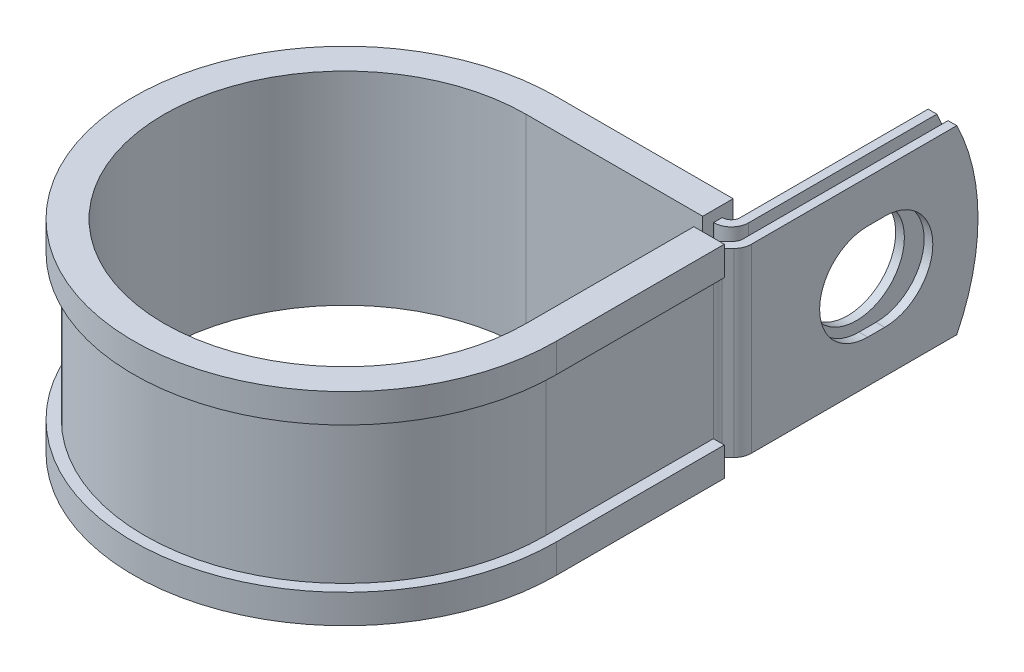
ISO-10303-21;
HEADER;
FILE_DESCRIPTION(('STEP AP214'),'2;1');
FILE_NAME('part.step','',(''),(''),'','','');
FILE_SCHEMA(('AUTOMOTIVE_DESIGN { 1 0 10303 214 1 1 1 1 }'));
ENDSEC;
DATA;
#1=APPLICATION_CONTEXT('core data for automotive mechanical design processes');
#2=APPLICATION_PROTOCOL_DEFINITION('international standard','automotive_design',2000,#1);
#3=PRODUCT_CONTEXT('',#1,'mechanical');
#4=PRODUCT('Part','Part','',(#3));
#5=PRODUCT_RELATED_PRODUCT_CATEGORY('part','',(#4));
#6=PRODUCT_DEFINITION_FORMATION('','',#4);
#7=PRODUCT_DEFINITION_CONTEXT('part definition',#1,'design');
#8=PRODUCT_DEFINITION('design','',#6,#7);
#9=PRODUCT_DEFINITION_SHAPE('','',#8);
#10=(LENGTH_UNIT() NAMED_UNIT(*) SI_UNIT(.MILLI.,.METRE.));
#11=(NAMED_UNIT(*) PLANE_ANGLE_UNIT() SI_UNIT($,.RADIAN.));
#12=(NAMED_UNIT(*) SI_UNIT($,.STERADIAN.) SOLID_ANGLE_UNIT());
#13=UNCERTAINTY_MEASURE_WITH_UNIT(LENGTH_MEASURE(1.E-05),#10,'distance_accuracy_value','');
#14=(GEOMETRIC_REPRESENTATION_CONTEXT(3) GLOBAL_UNCERTAINTY_ASSIGNED_CONTEXT((#13)) GLOBAL_UNIT_ASSIGNED_CONTEXT((#10,
#11,#12)) REPRESENTATION_CONTEXT('',''));
#15=CARTESIAN_POINT('',(0.,0.,0.));
#16=DIRECTION('',(0.,0.,1.));
#17=DIRECTION('',(1.,0.,0.));
#18=AXIS2_PLACEMENT_3D('',#15,#16,#17);
#19=CARTESIAN_POINT('',(27.6022698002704,-12.7,-26.924));
#20=DIRECTION('',(0.,1.,0.));
#21=DIRECTION('',(1.,0.,0.));
#22=AXIS2_PLACEMENT_3D('',#19,#20,#21);
#23=PLANE('',#22);
#24=DIRECTION('',(0.,0.,-1.));
#25=VECTOR('',#24,1.);
#26=CARTESIAN_POINT('',(24.7574698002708,-12.7,-26.924));
#27=LINE('',#26,#25);
#28=CARTESIAN_POINT('',(24.7574698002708,-12.7,-26.924));
#29=VERTEX_POINT('',#28);
#30=CARTESIAN_POINT('',(24.7574698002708,-12.7,-28.1432));
#31=VERTEX_POINT('',#30);
#32=EDGE_CURVE('E505',#29,#31,#27,.T.);
#33=ORIENTED_EDGE('',*,*,#32,.T.);
#34=DIRECTION('',(-1.,0.,0.));
#35=VECTOR('',#34,1.);
#36=CARTESIAN_POINT('',(0.,-12.7,-28.1432));
#37=LINE('',#36,#35);
#38=CARTESIAN_POINT('',(24.8082698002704,-12.7,-28.1432));
#39=VERTEX_POINT('',#38);
#40=EDGE_CURVE('E392',#39,#31,#37,.T.);
#41=ORIENTED_EDGE('',*,*,#40,.F.);
#42=CARTESIAN_POINT('',(24.8082698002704,-12.7,-29.3624));
#43=DIRECTION('',(0.,1.,0.));
#44=DIRECTION('',(1.,0.,0.));
#45=AXIS2_PLACEMENT_3D('',#42,#43,#44);
#46=CIRCLE('',#45,1.2192);
#47=CARTESIAN_POINT('',(26.0274698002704,-12.7,-29.3624));
#48=VERTEX_POINT('',#47);
#49=EDGE_CURVE('E390',#48,#39,#46,.F.);
#50=ORIENTED_EDGE('',*,*,#49,.F.);
#51=DIRECTION('',(0.,0.,1.));
#52=VECTOR('',#51,1.);
#53=CARTESIAN_POINT('',(26.0274698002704,-12.7,-58.7248));
#54=LINE('',#53,#52);
#55=CARTESIAN_POINT('',(26.0274698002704,-12.7,-55.7474683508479));
#56=VERTEX_POINT('',#55);
#57=EDGE_CURVE('E388',#56,#48,#54,.T.);
#58=ORIENTED_EDGE('',*,*,#57,.F.);
#59=DIRECTION('',(-1.,0.,0.));
#60=VECTOR('',#59,1.);
#61=CARTESIAN_POINT('',(30.0406698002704,-12.7,-55.7474683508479));
#62=LINE('',#61,#60);
#63=CARTESIAN_POINT('',(27.2466698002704,-12.7,-55.7474683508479));
#64=VERTEX_POINT('',#63);
#65=EDGE_CURVE('E11',#64,#56,#62,.T.);
#66=ORIENTED_EDGE('',*,*,#65,.F.);
#67=DIRECTION('',(0.,0.,1.));
#68=VECTOR('',#67,1.);
#69=CARTESIAN_POINT('',(27.2466698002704,-12.7,-58.7248));
#70=LINE('',#69,#68);
#71=CARTESIAN_POINT('',(27.2466698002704,-12.7,-29.3624));
#72=VERTEX_POINT('',#71);
#73=EDGE_CURVE('E386',#64,#72,#70,.T.);
#74=ORIENTED_EDGE('',*,*,#73,.T.);
#75=CARTESIAN_POINT('',(24.8082698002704,-12.7,-29.3624));
#76=DIRECTION('',(0.,-1.,0.));
#77=DIRECTION('',(0.,0.,1.));
#78=AXIS2_PLACEMENT_3D('',#75,#76,#77);
#79=CIRCLE('',#78,2.4384);
#80=CARTESIAN_POINT('',(24.8082698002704,-12.7,-26.924));
#81=VERTEX_POINT('',#80);
#82=EDGE_CURVE('E383',#72,#81,#79,.T.);
#83=ORIENTED_EDGE('',*,*,#82,.T.);
#84=DIRECTION('',(-1.,0.,0.));
#85=VECTOR('',#84,1.);
#86=CARTESIAN_POINT('',(0.,-12.7,-26.924));
#87=LINE('',#86,#85);
#88=EDGE_CURVE('E380',#81,#29,#87,.T.);
#89=ORIENTED_EDGE('',*,*,#88,.T.);
#90=EDGE_LOOP('',(#33,#41,#50,#58,#66,#74,#83,#89));
#91=FACE_BOUND('',#90,.T.);
#92=ADVANCED_FACE('F36',(#91),#23,.F.);
#93=CARTESIAN_POINT('',(27.6022698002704,12.7,-26.924));
#94=DIRECTION('',(0.,1.,0.));
#95=DIRECTION('',(1.,0.,0.));
#96=AXIS2_PLACEMENT_3D('',#93,#94,#95);
#97=PLANE('',#96);
#98=DIRECTION('',(-1.,0.,0.));
#99=VECTOR('',#98,1.);
#100=CARTESIAN_POINT('',(0.,12.7,-28.1432));
#101=LINE('',#100,#99);
#102=CARTESIAN_POINT('',(24.8082698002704,12.7,-28.1432));
#103=VERTEX_POINT('',#102);
#104=CARTESIAN_POINT('',(24.7574698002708,12.7,-28.1432));
#105=VERTEX_POINT('',#104);
#106=EDGE_CURVE('E350',#103,#105,#101,.T.);
#107=ORIENTED_EDGE('',*,*,#106,.T.);
#108=DIRECTION('',(0.,0.,1.));
#109=VECTOR('',#108,1.);
#110=CARTESIAN_POINT('',(24.7574698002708,12.7,-28.1432));
#111=LINE('',#110,#109);
#112=CARTESIAN_POINT('',(24.7574698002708,12.7,-26.924));
#113=VERTEX_POINT('',#112);
#114=EDGE_CURVE('E499',#105,#113,#111,.T.);
#115=ORIENTED_EDGE('',*,*,#114,.T.);
#116=DIRECTION('',(-1.,0.,0.));
#117=VECTOR('',#116,1.);
#118=CARTESIAN_POINT('',(0.,12.7,-26.924));
#119=LINE('',#118,#117);
#120=CARTESIAN_POINT('',(24.8082698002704,12.7,-26.924));
#121=VERTEX_POINT('',#120);
#122=EDGE_CURVE('E607',#121,#113,#119,.T.);
#123=ORIENTED_EDGE('',*,*,#122,.F.);
#124=CARTESIAN_POINT('',(24.8082698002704,12.7,-29.3624));
#125=DIRECTION('',(0.,-1.,0.));
#126=DIRECTION('',(0.,0.,1.));
#127=AXIS2_PLACEMENT_3D('',#124,#125,#126);
#128=CIRCLE('',#127,2.4384);
#129=CARTESIAN_POINT('',(27.2466698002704,12.7,-29.3624));
#130=VERTEX_POINT('',#129);
#131=EDGE_CURVE('E352',#130,#121,#128,.T.);
#132=ORIENTED_EDGE('',*,*,#131,.F.);
#133=DIRECTION('',(0.,0.,1.));
#134=VECTOR('',#133,1.);
#135=CARTESIAN_POINT('',(27.2466698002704,12.7,-58.7248));
#136=LINE('',#135,#134);
#137=CARTESIAN_POINT('',(27.2466698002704,12.7,-55.7474683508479));
#138=VERTEX_POINT('',#137);
#139=EDGE_CURVE('E343',#138,#130,#136,.T.);
#140=ORIENTED_EDGE('',*,*,#139,.F.);
#141=DIRECTION('',(-1.,0.,0.));
#142=VECTOR('',#141,1.);
#143=CARTESIAN_POINT('',(30.0406698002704,12.7,-55.7474683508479));
#144=LINE('',#143,#142);
#145=CARTESIAN_POINT('',(26.0274698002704,12.7,-55.7474683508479));
#146=VERTEX_POINT('',#145);
#147=EDGE_CURVE('E44',#138,#146,#144,.T.);
#148=ORIENTED_EDGE('',*,*,#147,.T.);
#149=DIRECTION('',(0.,0.,1.));
#150=VECTOR('',#149,1.);
#151=CARTESIAN_POINT('',(26.0274698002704,12.7,-58.7248));
#152=LINE('',#151,#150);
#153=CARTESIAN_POINT('',(26.0274698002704,12.7,-29.3624));
#154=VERTEX_POINT('',#153);
#155=EDGE_CURVE('E340',#146,#154,#152,.T.);
#156=ORIENTED_EDGE('',*,*,#155,.T.);
#157=CARTESIAN_POINT('',(24.8082698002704,12.7,-29.3624));
#158=DIRECTION('',(0.,1.,0.));
#159=DIRECTION('',(1.,0.,0.));
#160=AXIS2_PLACEMENT_3D('',#157,#158,#159);
#161=CIRCLE('',#160,1.2192);
#162=EDGE_CURVE('E348',#154,#103,#161,.F.);
#163=ORIENTED_EDGE('',*,*,#162,.T.);
#164=EDGE_LOOP('',(#107,#115,#123,#132,#140,#148,#156,#163));
#165=FACE_BOUND('',#164,.T.);
#166=ADVANCED_FACE('F339',(#165),#97,.T.);
#167=CARTESIAN_POINT('',(0.,12.7,-26.924));
#168=DIRECTION('',(0.,0.,1.));
#169=DIRECTION('',(1.,0.,0.));
#170=AXIS2_PLACEMENT_3D('',#167,#168,#169);
#171=PLANE('',#170);
#172=ORIENTED_EDGE('',*,*,#122,.T.);
#173=DIRECTION('',(0.,-1.,0.));
#174=VECTOR('',#173,1.);
#175=CARTESIAN_POINT('',(24.7574698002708,12.7,-26.924));
#176=LINE('',#175,#174);
#177=EDGE_CURVE('E502',#113,#29,#176,.T.);
#178=ORIENTED_EDGE('',*,*,#177,.T.);
#179=ORIENTED_EDGE('',*,*,#88,.F.);
#180=DIRECTION('',(0.,-1.,0.));
#181=VECTOR('',#180,1.);
#182=CARTESIAN_POINT('',(24.8082698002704,12.7,-26.924));
#183=LINE('',#182,#181);
#184=EDGE_CURVE('E326',#121,#81,#183,.T.);
#185=ORIENTED_EDGE('',*,*,#184,.F.);
#186=EDGE_LOOP('',(#172,#178,#179,#185));
#187=FACE_BOUND('',#186,.T.);
#188=ADVANCED_FACE('F617',(#187),#171,.T.);
#189=CARTESIAN_POINT('',(30.0406698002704,12.7,-26.924));
#190=DIRECTION('',(-1.,0.,0.));
#191=DIRECTION('',(0.,0.,1.));
#192=AXIS2_PLACEMENT_3D('',#189,#190,#191);
#193=PLANE('',#192);
#194=CARTESIAN_POINT('',(30.0406698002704,0.,-45.6437999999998));
#195=DIRECTION('',(1.,0.,0.));
#196=DIRECTION('',(0.,0.,-1.));
#197=AXIS2_PLACEMENT_3D('',#194,#195,#196);
#198=CIRCLE('',#197,6.7437);
#199=CARTESIAN_POINT('',(30.0406698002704,-6.7437,-45.6438000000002));
#200=VERTEX_POINT('',#199);
#201=CARTESIAN_POINT('',(30.0406698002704,6.7437,-45.6438000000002));
#202=VERTEX_POINT('',#201);
#203=EDGE_CURVE('E562',#200,#202,#198,.T.);
#204=ORIENTED_EDGE('',*,*,#203,.F.);
#205=DIRECTION('',(0.,0.,-1.));
#206=VECTOR('',#205,1.);
#207=CARTESIAN_POINT('',(30.0406698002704,-6.7437,-43.2561999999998));
#208=LINE('',#207,#206);
#209=CARTESIAN_POINT('',(30.0406698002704,-6.7437,-43.2561999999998));
#210=VERTEX_POINT('',#209);
#211=EDGE_CURVE('E565',#210,#200,#208,.T.);
#212=ORIENTED_EDGE('',*,*,#211,.F.);
#213=CARTESIAN_POINT('',(30.0406698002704,0.,-43.2561999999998));
#214=DIRECTION('',(1.,0.,0.));
#215=DIRECTION('',(0.,0.,-1.));
#216=AXIS2_PLACEMENT_3D('',#213,#214,#215);
#217=CIRCLE('',#216,6.7437);
#218=CARTESIAN_POINT('',(30.0406698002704,6.7437,-43.2561999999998));
#219=VERTEX_POINT('',#218);
#220=EDGE_CURVE('E558',#219,#210,#217,.T.);
#221=ORIENTED_EDGE('',*,*,#220,.F.);
#222=DIRECTION('',(0.,0.,1.));
#223=VECTOR('',#222,1.);
#224=CARTESIAN_POINT('',(30.0406698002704,6.7437,-43.2561999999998));
#225=LINE('',#224,#223);
#226=EDGE_CURVE('E559',#202,#219,#225,.T.);
#227=ORIENTED_EDGE('',*,*,#226,.F.);
#228=EDGE_LOOP('',(#204,#212,#221,#227));
#229=FACE_BOUND('',#228,.T.);
#230=DIRECTION('',(0.,0.,-1.));
#231=VECTOR('',#230,1.);
#232=CARTESIAN_POINT('',(30.0406698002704,-12.7,-26.924));
#233=LINE('',#232,#231);
#234=CARTESIAN_POINT('',(30.0406698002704,-12.7,-26.924));
#235=VERTEX_POINT('',#234);
#236=CARTESIAN_POINT('',(30.0406698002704,-12.7,-55.7474683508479));
#237=VERTEX_POINT('',#236);
#238=EDGE_CURVE('E364',#235,#237,#233,.T.);
#239=ORIENTED_EDGE('',*,*,#238,.T.);
#240=CARTESIAN_POINT('',(30.0406698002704,0.,-30.1498));
#241=DIRECTION('',(-1.,0.,0.));
#242=DIRECTION('',(0.,0.,1.));
#243=AXIS2_PLACEMENT_3D('',#240,#241,#242);
#244=CIRCLE('',#243,28.575);
#245=CARTESIAN_POINT('',(30.0406698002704,12.7,-55.7474683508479));
#246=VERTEX_POINT('',#245);
#247=EDGE_CURVE('E550',#246,#237,#244,.T.);
#248=ORIENTED_EDGE('',*,*,#247,.F.);
#249=DIRECTION('',(0.,0.,-1.));
#250=VECTOR('',#249,1.);
#251=CARTESIAN_POINT('',(30.0406698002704,12.7,-26.924));
#252=LINE('',#251,#250);
#253=CARTESIAN_POINT('',(30.0406698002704,12.7,-26.924));
#254=VERTEX_POINT('',#253);
#255=EDGE_CURVE('E401',#254,#246,#252,.T.);
#256=ORIENTED_EDGE('',*,*,#255,.F.);
#257=DIRECTION('',(0.,-1.,0.));
#258=VECTOR('',#257,1.);
#259=CARTESIAN_POINT('',(30.0406698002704,12.7,-26.924));
#260=LINE('',#259,#258);
#261=EDGE_CURVE('E363',#254,#235,#260,.T.);
#262=ORIENTED_EDGE('',*,*,#261,.T.);
#263=EDGE_LOOP('',(#239,#248,#256,#262));
#264=FACE_BOUND('',#263,.T.);
#265=ADVANCED_FACE('F38',(#229,#264),#193,.F.);
#266=CARTESIAN_POINT('',(28.8214698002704,12.7,-26.924));
#267=DIRECTION('',(-1.,0.,0.));
#268=DIRECTION('',(0.,0.,1.));
#269=AXIS2_PLACEMENT_3D('',#266,#267,#268);
#270=PLANE('',#269);
#271=DIRECTION('',(0.,0.,-1.));
#272=VECTOR('',#271,1.);
#273=CARTESIAN_POINT('',(28.8214698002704,-6.7437,-43.2561999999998));
#274=LINE('',#273,#272);
#275=CARTESIAN_POINT('',(28.8214698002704,-6.7437,-43.2561999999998));
#276=VERTEX_POINT('',#275);
#277=CARTESIAN_POINT('',(28.8214698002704,-6.7437,-45.6438000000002));
#278=VERTEX_POINT('',#277);
#279=EDGE_CURVE('E561',#276,#278,#274,.T.);
#280=ORIENTED_EDGE('',*,*,#279,.T.);
#281=CARTESIAN_POINT('',(28.8214698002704,0.,-45.6437999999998));
#282=DIRECTION('',(-1.,0.,0.));
#283=DIRECTION('',(0.,0.,1.));
#284=AXIS2_PLACEMENT_3D('',#281,#282,#283);
#285=CIRCLE('',#284,6.7437);
#286=CARTESIAN_POINT('',(28.8214698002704,6.7437,-45.6438000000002));
#287=VERTEX_POINT('',#286);
#288=EDGE_CURVE('E582',#278,#287,#285,.F.);
#289=ORIENTED_EDGE('',*,*,#288,.T.);
#290=DIRECTION('',(0.,0.,1.));
#291=VECTOR('',#290,1.);
#292=CARTESIAN_POINT('',(28.8214698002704,6.7437,-43.2561999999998));
#293=LINE('',#292,#291);
#294=CARTESIAN_POINT('',(28.8214698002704,6.7437,-43.2561999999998));
#295=VERTEX_POINT('',#294);
#296=EDGE_CURVE('E578',#287,#295,#293,.T.);
#297=ORIENTED_EDGE('',*,*,#296,.T.);
#298=CARTESIAN_POINT('',(28.8214698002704,0.,-43.2561999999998));
#299=DIRECTION('',(-1.,0.,0.));
#300=DIRECTION('',(0.,0.,1.));
#301=AXIS2_PLACEMENT_3D('',#298,#299,#300);
#302=CIRCLE('',#301,6.7437);
#303=EDGE_CURVE('E573',#295,#276,#302,.F.);
#304=ORIENTED_EDGE('',*,*,#303,.T.);
#305=EDGE_LOOP('',(#280,#289,#297,#304));
#306=FACE_BOUND('',#305,.T.);
#307=CARTESIAN_POINT('',(28.8214698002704,0.,-30.1498));
#308=DIRECTION('',(-1.,0.,0.));
#309=DIRECTION('',(0.,0.,1.));
#310=AXIS2_PLACEMENT_3D('',#307,#308,#309);
#311=CIRCLE('',#310,28.575);
#312=CARTESIAN_POINT('',(28.8214698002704,12.7,-55.7474683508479));
#313=VERTEX_POINT('',#312);
#314=CARTESIAN_POINT('',(28.8214698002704,-12.7,-55.7474683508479));
#315=VERTEX_POINT('',#314);
#316=EDGE_CURVE('E58',#313,#315,#311,.T.);
#317=ORIENTED_EDGE('',*,*,#316,.T.);
#318=DIRECTION('',(0.,0.,-1.));
#319=VECTOR('',#318,1.);
#320=CARTESIAN_POINT('',(28.8214698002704,-12.7,-26.924));
#321=LINE('',#320,#319);
#322=CARTESIAN_POINT('',(28.8214698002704,-12.7,-26.924));
#323=VERTEX_POINT('',#322);
#324=EDGE_CURVE('E367',#323,#315,#321,.T.);
#325=ORIENTED_EDGE('',*,*,#324,.F.);
#326=DIRECTION('',(0.,-1.,0.));
#327=VECTOR('',#326,1.);
#328=CARTESIAN_POINT('',(28.8214698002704,12.7,-26.924));
#329=LINE('',#328,#327);
#330=CARTESIAN_POINT('',(28.8214698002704,12.7,-26.924));
#331=VERTEX_POINT('',#330);
#332=EDGE_CURVE('E334',#331,#323,#329,.T.);
#333=ORIENTED_EDGE('',*,*,#332,.F.);
#334=DIRECTION('',(0.,0.,-1.));
#335=VECTOR('',#334,1.);
#336=CARTESIAN_POINT('',(28.8214698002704,12.7,-26.924));
#337=LINE('',#336,#335);
#338=EDGE_CURVE('E597',#331,#313,#337,.T.);
#339=ORIENTED_EDGE('',*,*,#338,.T.);
#340=EDGE_LOOP('',(#317,#325,#333,#339));
#341=FACE_BOUND('',#340,.T.);
#342=ADVANCED_FACE('F671',(#306,#341),#270,.T.);
#343=CARTESIAN_POINT('',(27.2466698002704,12.7,-58.7248));
#344=DIRECTION('',(1.,0.,0.));
#345=DIRECTION('',(0.,0.,-1.));
#346=AXIS2_PLACEMENT_3D('',#343,#344,#345);
#347=PLANE('',#346);
#348=CARTESIAN_POINT('',(27.2466698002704,0.,-44.45));
#349=DIRECTION('',(1.,0.,0.));
#350=DIRECTION('',(0.,0.,-1.));
#351=AXIS2_PLACEMENT_3D('',#348,#349,#350);
#352=CIRCLE('',#351,6.7437);
#353=CARTESIAN_POINT('',(27.2466698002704,0.,-51.1937));
#354=VERTEX_POINT('',#353);
#355=EDGE_CURVE('E368',#354,#354,#352,.F.);
#356=ORIENTED_EDGE('',*,*,#355,.T.);
#357=EDGE_LOOP('',(#356));
#358=FACE_BOUND('',#357,.T.);
#359=ORIENTED_EDGE('',*,*,#73,.F.);
#360=CARTESIAN_POINT('',(27.2466698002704,0.,-30.1498));
#361=DIRECTION('',(1.,0.,0.));
#362=DIRECTION('',(0.,0.,-1.));
#363=AXIS2_PLACEMENT_3D('',#360,#361,#362);
#364=CIRCLE('',#363,28.575);
#365=EDGE_CURVE('E555',#64,#138,#364,.T.);
#366=ORIENTED_EDGE('',*,*,#365,.T.);
#367=ORIENTED_EDGE('',*,*,#139,.T.);
#368=DIRECTION('',(0.,-1.,0.));
#369=VECTOR('',#368,1.);
#370=CARTESIAN_POINT('',(27.2466698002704,12.7,-29.3624));
#371=LINE('',#370,#369);
#372=EDGE_CURVE('E323',#130,#72,#371,.T.);
#373=ORIENTED_EDGE('',*,*,#372,.T.);
#374=EDGE_LOOP('',(#359,#366,#367,#373));
#375=FACE_BOUND('',#374,.T.);
#376=ADVANCED_FACE('F623',(#358,#375),#347,.T.);
#377=CARTESIAN_POINT('',(26.0274698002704,12.7,-58.7248));
#378=DIRECTION('',(1.,0.,0.));
#379=DIRECTION('',(0.,0.,-1.));
#380=AXIS2_PLACEMENT_3D('',#377,#378,#379);
#381=PLANE('',#380);
#382=CARTESIAN_POINT('',(26.0274698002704,0.,-44.45));
#383=DIRECTION('',(-1.,0.,0.));
#384=DIRECTION('',(0.,0.,1.));
#385=AXIS2_PLACEMENT_3D('',#382,#383,#384);
#386=CIRCLE('',#385,6.7437);
#387=CARTESIAN_POINT('',(26.0274698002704,0.,-37.7063));
#388=VERTEX_POINT('',#387);
#389=EDGE_CURVE('E590',#388,#388,#386,.T.);
#390=ORIENTED_EDGE('',*,*,#389,.F.);
#391=EDGE_LOOP('',(#390));
#392=FACE_BOUND('',#391,.T.);
#393=CARTESIAN_POINT('',(26.0274698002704,0.,-30.1498));
#394=DIRECTION('',(-1.,0.,0.));
#395=DIRECTION('',(0.,0.,1.));
#396=AXIS2_PLACEMENT_3D('',#393,#394,#395);
#397=CIRCLE('',#396,28.575);
#398=EDGE_CURVE('E50',#146,#56,#397,.T.);
#399=ORIENTED_EDGE('',*,*,#398,.T.);
#400=ORIENTED_EDGE('',*,*,#57,.T.);
#401=DIRECTION('',(0.,-1.,0.));
#402=VECTOR('',#401,1.);
#403=CARTESIAN_POINT('',(26.0274698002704,12.7,-29.3624));
#404=LINE('',#403,#402);
#405=EDGE_CURVE('E320',#154,#48,#404,.T.);
#406=ORIENTED_EDGE('',*,*,#405,.F.);
#407=ORIENTED_EDGE('',*,*,#155,.F.);
#408=EDGE_LOOP('',(#399,#400,#406,#407));
#409=FACE_BOUND('',#408,.T.);
#410=ADVANCED_FACE('F346',(#392,#409),#381,.F.);
#411=CARTESIAN_POINT('',(29.3624,-12.7,-23.5115026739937));
#412=DIRECTION('',(0.,1.,0.));
#413=DIRECTION('',(1.,0.,0.));
#414=AXIS2_PLACEMENT_3D('',#411,#412,#413);
#415=CIRCLE('',#414,1.2192);
#416=CARTESIAN_POINT('',(28.1432,-12.7,-23.5115026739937));
#417=VERTEX_POINT('',#416);
#418=CARTESIAN_POINT('',(28.5002954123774,-12.7,-24.3736072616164));
#419=VERTEX_POINT('',#418);
#420=EDGE_CURVE('E395',#417,#419,#415,.F.);
#421=ORIENTED_EDGE('',*,*,#420,.F.);
#422=DIRECTION('',(1.,0.,0.));
#423=VECTOR('',#422,1.);
#424=CARTESIAN_POINT('',(26.924,-12.7,-23.5115026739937));
#425=LINE('',#424,#423);
#426=CARTESIAN_POINT('',(26.924,-12.7,-23.5115026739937));
#427=VERTEX_POINT('',#426);
#428=EDGE_CURVE('E433',#427,#417,#425,.T.);
#429=ORIENTED_EDGE('',*,*,#428,.F.);
#430=CARTESIAN_POINT('',(29.3624,-12.7,-23.5115026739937));
#431=DIRECTION('',(0.,-1.,0.));
#432=DIRECTION('',(0.,0.,1.));
#433=AXIS2_PLACEMENT_3D('',#430,#431,#432);
#434=CIRCLE('',#433,2.4384);
#435=CARTESIAN_POINT('',(27.6381908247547,-12.7,-25.235711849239));
#436=VERTEX_POINT('',#435);
#437=EDGE_CURVE('E377',#427,#436,#434,.T.);
#438=ORIENTED_EDGE('',*,*,#437,.T.);
#439=DIRECTION('',(0.707106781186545,0.,-0.70710678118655));
#440=VECTOR('',#439,1.);
#441=CARTESIAN_POINT('',(27.6381908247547,-12.7,-25.235711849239));
#442=LINE('',#441,#440);
#443=CARTESIAN_POINT('',(28.4643743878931,-12.7,-26.0618954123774));
#444=VERTEX_POINT('',#443);
#445=EDGE_CURVE('E374',#436,#444,#442,.T.);
#446=ORIENTED_EDGE('',*,*,#445,.T.);
#447=CARTESIAN_POINT('',(27.6022698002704,-12.7,-26.924));
#448=DIRECTION('',(0.,1.,0.));
#449=DIRECTION('',(0.,0.,1.));
#450=AXIS2_PLACEMENT_3D('',#447,#448,#449);
#451=CIRCLE('',#450,1.2192);
#452=EDGE_CURVE('E371',#444,#323,#451,.T.);
#453=ORIENTED_EDGE('',*,*,#452,.T.);
#454=ORIENTED_EDGE('',*,*,#324,.T.);
#455=DIRECTION('',(-1.,0.,0.));
#456=VECTOR('',#455,1.);
#457=CARTESIAN_POINT('',(30.0406698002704,-12.7,-55.7474683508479));
#458=LINE('',#457,#456);
#459=EDGE_CURVE('E548',#237,#315,#458,.T.);
#460=ORIENTED_EDGE('',*,*,#459,.F.);
#461=ORIENTED_EDGE('',*,*,#238,.F.);
#462=CARTESIAN_POINT('',(27.6022698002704,-12.7,-26.924));
#463=DIRECTION('',(0.,1.,0.));
#464=DIRECTION('',(1.,0.,0.));
#465=AXIS2_PLACEMENT_3D('',#462,#463,#464);
#466=CIRCLE('',#465,2.4384);
#467=CARTESIAN_POINT('',(29.3264789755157,-12.7,-25.1997908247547));
#468=VERTEX_POINT('',#467);
#469=EDGE_CURVE('E399',#468,#235,#466,.T.);
#470=ORIENTED_EDGE('',*,*,#469,.F.);
#471=DIRECTION('',(0.707106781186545,0.,-0.70710678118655));
#472=VECTOR('',#471,1.);
#473=CARTESIAN_POINT('',(28.5002954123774,-12.7,-24.3736072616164));
#474=LINE('',#473,#472);
#475=EDGE_CURVE('E397',#419,#468,#474,.T.);
#476=ORIENTED_EDGE('',*,*,#475,.F.);
#477=EDGE_LOOP('',(#421,#429,#438,#446,#453,#454,#460,#461,#470,#476));
#478=FACE_BOUND('',#477,.T.);
#479=ADVANCED_FACE('F657',(#478),#23,.F.);
#480=DIRECTION('',(-1.,0.,0.));
#481=VECTOR('',#480,1.);
#482=CARTESIAN_POINT('',(28.1432,12.7,-23.5115026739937));
#483=LINE('',#482,#481);
#484=CARTESIAN_POINT('',(28.1432,12.7,-23.5115026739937));
#485=VERTEX_POINT('',#484);
#486=CARTESIAN_POINT('',(26.924,12.7,-23.5115026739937));
#487=VERTEX_POINT('',#486);
#488=EDGE_CURVE('E422',#485,#487,#483,.T.);
#489=ORIENTED_EDGE('',*,*,#488,.F.);
#490=CARTESIAN_POINT('',(29.3624,12.7,-23.5115026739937));
#491=DIRECTION('',(0.,1.,0.));
#492=DIRECTION('',(1.,0.,0.));
#493=AXIS2_PLACEMENT_3D('',#490,#491,#492);
#494=CIRCLE('',#493,1.2192);
#495=CARTESIAN_POINT('',(28.5002954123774,12.7,-24.3736072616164));
#496=VERTEX_POINT('',#495);
#497=EDGE_CURVE('E357',#485,#496,#494,.F.);
#498=ORIENTED_EDGE('',*,*,#497,.T.);
#499=DIRECTION('',(0.707106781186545,0.,-0.70710678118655));
#500=VECTOR('',#499,1.);
#501=CARTESIAN_POINT('',(28.5002954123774,12.7,-24.3736072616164));
#502=LINE('',#501,#500);
#503=CARTESIAN_POINT('',(29.3264789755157,12.7,-25.1997908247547));
#504=VERTEX_POINT('',#503);
#505=EDGE_CURVE('E359',#496,#504,#502,.T.);
#506=ORIENTED_EDGE('',*,*,#505,.T.);
#507=CARTESIAN_POINT('',(27.6022698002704,12.7,-26.924));
#508=DIRECTION('',(0.,1.,0.));
#509=DIRECTION('',(1.,0.,0.));
#510=AXIS2_PLACEMENT_3D('',#507,#508,#509);
#511=CIRCLE('',#510,2.4384);
#512=EDGE_CURVE('E361',#504,#254,#511,.T.);
#513=ORIENTED_EDGE('',*,*,#512,.T.);
#514=ORIENTED_EDGE('',*,*,#255,.T.);
#515=DIRECTION('',(-1.,0.,0.));
#516=VECTOR('',#515,1.);
#517=CARTESIAN_POINT('',(30.0406698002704,12.7,-55.7474683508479));
#518=LINE('',#517,#516);
#519=EDGE_CURVE('E552',#246,#313,#518,.T.);
#520=ORIENTED_EDGE('',*,*,#519,.T.);
#521=ORIENTED_EDGE('',*,*,#338,.F.);
#522=CARTESIAN_POINT('',(27.6022698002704,12.7,-26.924));
#523=DIRECTION('',(0.,1.,0.));
#524=DIRECTION('',(0.,0.,1.));
#525=AXIS2_PLACEMENT_3D('',#522,#523,#524);
#526=CIRCLE('',#525,1.2192);
#527=CARTESIAN_POINT('',(28.4643743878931,12.7,-26.0618954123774));
#528=VERTEX_POINT('',#527);
#529=EDGE_CURVE('E600',#528,#331,#526,.T.);
#530=ORIENTED_EDGE('',*,*,#529,.F.);
#531=DIRECTION('',(0.707106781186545,0.,-0.70710678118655));
#532=VECTOR('',#531,1.);
#533=CARTESIAN_POINT('',(27.6381908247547,12.7,-25.235711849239));
#534=LINE('',#533,#532);
#535=CARTESIAN_POINT('',(27.6381908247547,12.7,-25.235711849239));
#536=VERTEX_POINT('',#535);
#537=EDGE_CURVE('E603',#536,#528,#534,.T.);
#538=ORIENTED_EDGE('',*,*,#537,.F.);
#539=CARTESIAN_POINT('',(29.3624,12.7,-23.5115026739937));
#540=DIRECTION('',(0.,-1.,0.));
#541=DIRECTION('',(0.,0.,1.));
#542=AXIS2_PLACEMENT_3D('',#539,#540,#541);
#543=CIRCLE('',#542,2.4384);
#544=EDGE_CURVE('E432',#487,#536,#543,.T.);
#545=ORIENTED_EDGE('',*,*,#544,.F.);
#546=EDGE_LOOP('',(#489,#498,#506,#513,#514,#520,#521,#530,#538,#545));
#547=FACE_BOUND('',#546,.T.);
#548=ADVANCED_FACE('F429',(#547),#97,.T.);
#549=CARTESIAN_POINT('',(27.6022698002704,12.7,-26.924));
#550=DIRECTION('',(0.,-1.,0.));
#551=DIRECTION('',(0.,0.,-1.));
#552=AXIS2_PLACEMENT_3D('',#549,#550,#551);
#553=CYLINDRICAL_SURFACE('',#552,1.2192);
#554=ORIENTED_EDGE('',*,*,#452,.F.);
#555=DIRECTION('',(0.,-1.,0.));
#556=VECTOR('',#555,1.);
#557=CARTESIAN_POINT('',(28.4643743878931,12.7,-26.0618954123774));
#558=LINE('',#557,#556);
#559=EDGE_CURVE('E332',#528,#444,#558,.T.);
#560=ORIENTED_EDGE('',*,*,#559,.F.);
#561=ORIENTED_EDGE('',*,*,#529,.T.);
#562=ORIENTED_EDGE('',*,*,#332,.T.);
#563=EDGE_LOOP('',(#554,#560,#561,#562));
#564=FACE_BOUND('',#563,.T.);
#565=ADVANCED_FACE('F667',(#564),#553,.F.);
#566=CARTESIAN_POINT('',(27.6381908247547,12.7,-25.235711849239));
#567=DIRECTION('',(-0.70710678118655,0.,-0.707106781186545));
#568=DIRECTION('',(-0.707106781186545,0.,0.70710678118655));
#569=AXIS2_PLACEMENT_3D('',#566,#567,#568);
#570=PLANE('',#569);
#571=ORIENTED_EDGE('',*,*,#445,.F.);
#572=DIRECTION('',(0.,-1.,0.));
#573=VECTOR('',#572,1.);
#574=CARTESIAN_POINT('',(27.6381908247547,12.7,-25.235711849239));
#575=LINE('',#574,#573);
#576=EDGE_CURVE('E330',#536,#436,#575,.T.);
#577=ORIENTED_EDGE('',*,*,#576,.F.);
#578=ORIENTED_EDGE('',*,*,#537,.T.);
#579=ORIENTED_EDGE('',*,*,#559,.T.);
#580=EDGE_LOOP('',(#571,#577,#578,#579));
#581=FACE_BOUND('',#580,.T.);
#582=ADVANCED_FACE('F662',(#581),#570,.T.);
#583=CARTESIAN_POINT('',(29.3624,12.7,-23.5115026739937));
#584=DIRECTION('',(0.,-1.,0.));
#585=DIRECTION('',(0.,0.,-1.));
#586=AXIS2_PLACEMENT_3D('',#583,#584,#585);
#587=CYLINDRICAL_SURFACE('',#586,2.4384);
#588=ORIENTED_EDGE('',*,*,#437,.F.);
#589=DIRECTION('',(0.,-1.,0.));
#590=VECTOR('',#589,1.);
#591=CARTESIAN_POINT('',(26.924,12.7,-23.5115026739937));
#592=LINE('',#591,#590);
#593=EDGE_CURVE('E328',#487,#427,#592,.T.);
#594=ORIENTED_EDGE('',*,*,#593,.F.);
#595=ORIENTED_EDGE('',*,*,#544,.T.);
#596=ORIENTED_EDGE('',*,*,#576,.T.);
#597=EDGE_LOOP('',(#588,#594,#595,#596));
#598=FACE_BOUND('',#597,.T.);
#599=ADVANCED_FACE('F659',(#598),#587,.T.);
#600=CARTESIAN_POINT('',(24.8082698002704,12.7,-29.3624));
#601=DIRECTION('',(0.,-1.,0.));
#602=DIRECTION('',(0.,0.,-1.));
#603=AXIS2_PLACEMENT_3D('',#600,#601,#602);
#604=CYLINDRICAL_SURFACE('',#603,2.4384);
#605=ORIENTED_EDGE('',*,*,#82,.F.);
#606=ORIENTED_EDGE('',*,*,#372,.F.);
#607=ORIENTED_EDGE('',*,*,#131,.T.);
#608=ORIENTED_EDGE('',*,*,#184,.T.);
#609=EDGE_LOOP('',(#605,#606,#607,#608));
#610=FACE_BOUND('',#609,.T.);
#611=ADVANCED_FACE('F613',(#610),#604,.T.);
#612=CARTESIAN_POINT('',(24.8082698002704,12.7,-29.3624));
#613=DIRECTION('',(0.,-1.,0.));
#614=DIRECTION('',(0.,0.,-1.));
#615=AXIS2_PLACEMENT_3D('',#612,#613,#614);
#616=CYLINDRICAL_SURFACE('',#615,1.2192);
#617=ORIENTED_EDGE('',*,*,#49,.T.);
#618=DIRECTION('',(0.,-1.,0.));
#619=VECTOR('',#618,1.);
#620=CARTESIAN_POINT('',(24.8082698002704,12.7,-28.1432));
#621=LINE('',#620,#619);
#622=EDGE_CURVE('E311',#103,#39,#621,.T.);
#623=ORIENTED_EDGE('',*,*,#622,.F.);
#624=ORIENTED_EDGE('',*,*,#162,.F.);
#625=ORIENTED_EDGE('',*,*,#405,.T.);
#626=EDGE_LOOP('',(#617,#623,#624,#625));
#627=FACE_BOUND('',#626,.T.);
#628=ADVANCED_FACE('F628',(#627),#616,.F.);
#629=CARTESIAN_POINT('',(0.,12.7,-28.1432));
#630=DIRECTION('',(0.,0.,1.));
#631=DIRECTION('',(1.,0.,0.));
#632=AXIS2_PLACEMENT_3D('',#629,#630,#631);
#633=PLANE('',#632);
#634=DIRECTION('',(0.,-1.,0.));
#635=VECTOR('',#634,1.);
#636=CARTESIAN_POINT('',(0.,12.7,-28.1432));
#637=LINE('',#636,#635);
#638=CARTESIAN_POINT('',(3.94769104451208E-13,10.16,-28.1432));
#639=VERTEX_POINT('',#638);
#640=CARTESIAN_POINT('',(3.94769104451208E-13,-10.16,-28.1432));
#641=VERTEX_POINT('',#640);
#642=EDGE_CURVE('E302',#639,#641,#637,.T.);
#643=ORIENTED_EDGE('',*,*,#642,.F.);
#644=DIRECTION('',(1.,0.,0.));
#645=VECTOR('',#644,1.);
#646=CARTESIAN_POINT('',(3.94769104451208E-13,10.16,-28.1432));
#647=LINE('',#646,#645);
#648=CARTESIAN_POINT('',(24.7574698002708,10.16,-28.1432));
#649=VERTEX_POINT('',#648);
#650=EDGE_CURVE('E545',#639,#649,#647,.T.);
#651=ORIENTED_EDGE('',*,*,#650,.T.);
#652=DIRECTION('',(0.,1.,0.));
#653=VECTOR('',#652,1.);
#654=CARTESIAN_POINT('',(24.7574698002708,12.7,-28.1432));
#655=LINE('',#654,#653);
#656=EDGE_CURVE('E496',#649,#105,#655,.T.);
#657=ORIENTED_EDGE('',*,*,#656,.T.);
#658=ORIENTED_EDGE('',*,*,#106,.F.);
#659=ORIENTED_EDGE('',*,*,#622,.T.);
#660=ORIENTED_EDGE('',*,*,#40,.T.);
#661=DIRECTION('',(0.,1.,0.));
#662=VECTOR('',#661,1.);
#663=CARTESIAN_POINT('',(24.7574698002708,-12.7,-28.1432));
#664=LINE('',#663,#662);
#665=CARTESIAN_POINT('',(24.7574698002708,-10.16,-28.1432));
#666=VERTEX_POINT('',#665);
#667=EDGE_CURVE('E508',#31,#666,#664,.T.);
#668=ORIENTED_EDGE('',*,*,#667,.T.);
#669=DIRECTION('',(1.,0.,0.));
#670=VECTOR('',#669,1.);
#671=CARTESIAN_POINT('',(3.94769104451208E-13,-10.16,-28.1432));
#672=LINE('',#671,#670);
#673=EDGE_CURVE('E525',#641,#666,#672,.T.);
#674=ORIENTED_EDGE('',*,*,#673,.F.);
#675=EDGE_LOOP('',(#643,#651,#657,#658,#659,#660,#668,#674));
#676=FACE_BOUND('',#675,.T.);
#677=ADVANCED_FACE('F632',(#676),#633,.F.);
#678=CARTESIAN_POINT('',(0.,12.7,0.));
#679=DIRECTION('',(0.,-1.,0.));
#680=DIRECTION('',(0.,0.,-1.));
#681=AXIS2_PLACEMENT_3D('',#678,#679,#680);
#682=CYLINDRICAL_SURFACE('',#681,28.1432);
#683=DIRECTION('',(0.,-1.,0.));
#684=VECTOR('',#683,1.);
#685=CARTESIAN_POINT('',(28.1432,12.7,0.));
#686=LINE('',#685,#684);
#687=CARTESIAN_POINT('',(28.1432,10.16,0.));
#688=VERTEX_POINT('',#687);
#689=CARTESIAN_POINT('',(28.1432,-10.16,0.));
#690=VERTEX_POINT('',#689);
#691=EDGE_CURVE('E300',#688,#690,#686,.T.);
#692=ORIENTED_EDGE('',*,*,#691,.F.);
#693=CARTESIAN_POINT('',(0.,10.16,0.));
#694=DIRECTION('',(0.,-1.,0.));
#695=DIRECTION('',(0.,0.,-1.));
#696=AXIS2_PLACEMENT_3D('',#693,#694,#695);
#697=CIRCLE('',#696,28.1432);
#698=EDGE_CURVE('E494',#688,#639,#697,.T.);
#699=ORIENTED_EDGE('',*,*,#698,.T.);
#700=ORIENTED_EDGE('',*,*,#642,.T.);
#701=CARTESIAN_POINT('',(0.,-10.16,0.));
#702=DIRECTION('',(0.,-1.,0.));
#703=DIRECTION('',(0.,0.,-1.));
#704=AXIS2_PLACEMENT_3D('',#701,#702,#703);
#705=CIRCLE('',#704,28.1432);
#706=EDGE_CURVE('E283',#690,#641,#705,.T.);
#707=ORIENTED_EDGE('',*,*,#706,.F.);
#708=EDGE_LOOP('',(#692,#699,#700,#707));
#709=FACE_BOUND('',#708,.T.);
#710=ADVANCED_FACE('F298',(#709),#682,.T.);
#711=CARTESIAN_POINT('',(28.1432,12.7,0.));
#712=DIRECTION('',(-1.,0.,0.));
#713=DIRECTION('',(0.,0.,1.));
#714=AXIS2_PLACEMENT_3D('',#711,#712,#713);
#715=PLANE('',#714);
#716=DIRECTION('',(0.,-1.,0.));
#717=VECTOR('',#716,1.);
#718=CARTESIAN_POINT('',(28.1432,12.7,-23.5115026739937));
#719=LINE('',#718,#717);
#720=CARTESIAN_POINT('',(28.1432,10.16,-23.5115026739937));
#721=VERTEX_POINT('',#720);
#722=CARTESIAN_POINT('',(28.1432,-10.16,-23.5115026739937));
#723=VERTEX_POINT('',#722);
#724=EDGE_CURVE('E314',#721,#723,#719,.T.);
#725=ORIENTED_EDGE('',*,*,#724,.F.);
#726=DIRECTION('',(0.,0.,-1.));
#727=VECTOR('',#726,1.);
#728=CARTESIAN_POINT('',(28.1432,10.16,0.));
#729=LINE('',#728,#727);
#730=EDGE_CURVE('E308',#688,#721,#729,.T.);
#731=ORIENTED_EDGE('',*,*,#730,.F.);
#732=ORIENTED_EDGE('',*,*,#691,.T.);
#733=DIRECTION('',(0.,0.,-1.));
#734=VECTOR('',#733,1.);
#735=CARTESIAN_POINT('',(28.1432,-10.16,0.));
#736=LINE('',#735,#734);
#737=EDGE_CURVE('E279',#690,#723,#736,.T.);
#738=ORIENTED_EDGE('',*,*,#737,.T.);
#739=EDGE_LOOP('',(#725,#731,#732,#738));
#740=FACE_BOUND('',#739,.T.);
#741=ADVANCED_FACE('F307',(#740),#715,.F.);
#742=CARTESIAN_POINT('',(29.3624,12.7,-23.5115026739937));
#743=DIRECTION('',(0.,-1.,0.));
#744=DIRECTION('',(0.,0.,-1.));
#745=AXIS2_PLACEMENT_3D('',#742,#743,#744);
#746=CYLINDRICAL_SURFACE('',#745,1.2192);
#747=ORIENTED_EDGE('',*,*,#420,.T.);
#748=DIRECTION('',(0.,-1.,0.));
#749=VECTOR('',#748,1.);
#750=CARTESIAN_POINT('',(28.5002954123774,12.7,-24.3736072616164));
#751=LINE('',#750,#749);
#752=EDGE_CURVE('E406',#496,#419,#751,.T.);
#753=ORIENTED_EDGE('',*,*,#752,.F.);
#754=ORIENTED_EDGE('',*,*,#497,.F.);
#755=EDGE_CURVE('E309',#485,#721,#719,.T.);
#756=ORIENTED_EDGE('',*,*,#755,.T.);
#757=ORIENTED_EDGE('',*,*,#724,.T.);
#758=DIRECTION('',(0.,1.,0.));
#759=VECTOR('',#758,1.);
#760=CARTESIAN_POINT('',(28.1432,-12.7,-23.5115026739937));
#761=LINE('',#760,#759);
#762=EDGE_CURVE('E415',#417,#723,#761,.T.);
#763=ORIENTED_EDGE('',*,*,#762,.F.);
#764=EDGE_LOOP('',(#747,#753,#754,#756,#757,#763));
#765=FACE_BOUND('',#764,.T.);
#766=ADVANCED_FACE('F414',(#765),#746,.F.);
#767=CARTESIAN_POINT('',(28.5002954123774,12.7,-24.3736072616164));
#768=DIRECTION('',(-0.70710678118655,0.,-0.707106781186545));
#769=DIRECTION('',(-0.707106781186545,0.,0.70710678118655));
#770=AXIS2_PLACEMENT_3D('',#767,#768,#769);
#771=PLANE('',#770);
#772=ORIENTED_EDGE('',*,*,#475,.T.);
#773=DIRECTION('',(0.,-1.,0.));
#774=VECTOR('',#773,1.);
#775=CARTESIAN_POINT('',(29.3264789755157,12.7,-25.1997908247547));
#776=LINE('',#775,#774);
#777=EDGE_CURVE('E404',#504,#468,#776,.T.);
#778=ORIENTED_EDGE('',*,*,#777,.F.);
#779=ORIENTED_EDGE('',*,*,#505,.F.);
#780=ORIENTED_EDGE('',*,*,#752,.T.);
#781=EDGE_LOOP('',(#772,#778,#779,#780));
#782=FACE_BOUND('',#781,.T.);
#783=ADVANCED_FACE('F683',(#782),#771,.F.);
#784=CARTESIAN_POINT('',(27.6022698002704,12.7,-26.924));
#785=DIRECTION('',(0.,-1.,0.));
#786=DIRECTION('',(0.,0.,-1.));
#787=AXIS2_PLACEMENT_3D('',#784,#785,#786);
#788=CYLINDRICAL_SURFACE('',#787,2.4384);
#789=ORIENTED_EDGE('',*,*,#469,.T.);
#790=ORIENTED_EDGE('',*,*,#261,.F.);
#791=ORIENTED_EDGE('',*,*,#512,.F.);
#792=ORIENTED_EDGE('',*,*,#777,.T.);
#793=EDGE_LOOP('',(#789,#790,#791,#792));
#794=FACE_BOUND('',#793,.T.);
#795=ADVANCED_FACE('F681',(#794),#788,.T.);
#796=CARTESIAN_POINT('',(46.3207338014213,0.,-44.45));
#797=DIRECTION('',(-1.,0.,0.));
#798=DIRECTION('',(0.,0.,1.));
#799=AXIS2_PLACEMENT_3D('',#796,#797,#798);
#800=CYLINDRICAL_SURFACE('',#799,6.7437);
#801=ORIENTED_EDGE('',*,*,#389,.T.);
#802=EDGE_LOOP('',(#801));
#803=FACE_BOUND('',#802,.T.);
#804=ORIENTED_EDGE('',*,*,#355,.F.);
#805=EDGE_LOOP('',(#804));
#806=FACE_BOUND('',#805,.T.);
#807=ADVANCED_FACE('F690',(#803,#806),#800,.F.);
#808=CARTESIAN_POINT('',(7.99058926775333,-6.7437,-43.2561999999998));
#809=DIRECTION('',(0.,-1.,0.));
#810=DIRECTION('',(0.,0.,-1.));
#811=AXIS2_PLACEMENT_3D('',#808,#809,#810);
#812=PLANE('',#811);
#813=DIRECTION('',(1.,0.,0.));
#814=VECTOR('',#813,1.);
#815=CARTESIAN_POINT('',(7.99058926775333,-6.7437,-43.2561999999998));
#816=LINE('',#815,#814);
#817=EDGE_CURVE('E576',#276,#210,#816,.T.);
#818=ORIENTED_EDGE('',*,*,#817,.T.);
#819=ORIENTED_EDGE('',*,*,#211,.T.);
#820=DIRECTION('',(1.,0.,0.));
#821=VECTOR('',#820,1.);
#822=CARTESIAN_POINT('',(7.99058926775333,-6.7437,-45.6438000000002));
#823=LINE('',#822,#821);
#824=EDGE_CURVE('E572',#278,#200,#823,.T.);
#825=ORIENTED_EDGE('',*,*,#824,.F.);
#826=ORIENTED_EDGE('',*,*,#279,.F.);
#827=EDGE_LOOP('',(#818,#819,#825,#826));
#828=FACE_BOUND('',#827,.T.);
#829=ADVANCED_FACE('F733',(#828),#812,.F.);
#830=CARTESIAN_POINT('',(7.99058926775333,0.,-45.6437999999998));
#831=DIRECTION('',(1.,0.,0.));
#832=DIRECTION('',(0.,0.,-1.));
#833=AXIS2_PLACEMENT_3D('',#830,#831,#832);
#834=CYLINDRICAL_SURFACE('',#833,6.7437);
#835=ORIENTED_EDGE('',*,*,#824,.T.);
#836=ORIENTED_EDGE('',*,*,#203,.T.);
#837=DIRECTION('',(1.,0.,0.));
#838=VECTOR('',#837,1.);
#839=CARTESIAN_POINT('',(7.99058926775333,6.7437,-45.6438000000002));
#840=LINE('',#839,#838);
#841=EDGE_CURVE('E581',#287,#202,#840,.T.);
#842=ORIENTED_EDGE('',*,*,#841,.F.);
#843=ORIENTED_EDGE('',*,*,#288,.F.);
#844=EDGE_LOOP('',(#835,#836,#842,#843));
#845=FACE_BOUND('',#844,.T.);
#846=ADVANCED_FACE('F737',(#845),#834,.F.);
#847=CARTESIAN_POINT('',(7.99058926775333,6.7437,-43.2561999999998));
#848=DIRECTION('',(0.,1.,0.));
#849=DIRECTION('',(0.,0.,1.));
#850=AXIS2_PLACEMENT_3D('',#847,#848,#849);
#851=PLANE('',#850);
#852=ORIENTED_EDGE('',*,*,#841,.T.);
#853=ORIENTED_EDGE('',*,*,#226,.T.);
#854=DIRECTION('',(1.,0.,0.));
#855=VECTOR('',#854,1.);
#856=CARTESIAN_POINT('',(7.99058926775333,6.7437,-43.2561999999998));
#857=LINE('',#856,#855);
#858=EDGE_CURVE('E577',#295,#219,#857,.T.);
#859=ORIENTED_EDGE('',*,*,#858,.F.);
#860=ORIENTED_EDGE('',*,*,#296,.F.);
#861=EDGE_LOOP('',(#852,#853,#859,#860));
#862=FACE_BOUND('',#861,.T.);
#863=ADVANCED_FACE('F741',(#862),#851,.F.);
#864=CARTESIAN_POINT('',(7.99058926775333,0.,-43.2561999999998));
#865=DIRECTION('',(1.,0.,0.));
#866=DIRECTION('',(0.,0.,-1.));
#867=AXIS2_PLACEMENT_3D('',#864,#865,#866);
#868=CYLINDRICAL_SURFACE('',#867,6.7437);
#869=ORIENTED_EDGE('',*,*,#858,.T.);
#870=ORIENTED_EDGE('',*,*,#220,.T.);
#871=ORIENTED_EDGE('',*,*,#817,.F.);
#872=ORIENTED_EDGE('',*,*,#303,.F.);
#873=EDGE_LOOP('',(#869,#870,#871,#872));
#874=FACE_BOUND('',#873,.T.);
#875=ADVANCED_FACE('F745',(#874),#868,.F.);
#876=CARTESIAN_POINT('',(30.0406698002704,0.,-30.1498));
#877=DIRECTION('',(-1.,0.,0.));
#878=DIRECTION('',(0.,0.,1.));
#879=AXIS2_PLACEMENT_3D('',#876,#877,#878);
#880=CYLINDRICAL_SURFACE('',#879,28.575);
#881=ORIENTED_EDGE('',*,*,#365,.F.);
#882=ORIENTED_EDGE('',*,*,#65,.T.);
#883=ORIENTED_EDGE('',*,*,#398,.F.);
#884=ORIENTED_EDGE('',*,*,#147,.F.);
#885=EDGE_LOOP('',(#881,#882,#883,#884));
#886=FACE_BOUND('',#885,.T.);
#887=ADVANCED_FACE('F624',(#886),#880,.T.);
#888=ORIENTED_EDGE('',*,*,#519,.F.);
#889=ORIENTED_EDGE('',*,*,#247,.T.);
#890=ORIENTED_EDGE('',*,*,#459,.T.);
#891=ORIENTED_EDGE('',*,*,#316,.F.);
#892=EDGE_LOOP('',(#888,#889,#890,#891));
#893=FACE_BOUND('',#892,.T.);
#894=ADVANCED_FACE('F672',(#893),#880,.T.);
#895=CARTESIAN_POINT('',(4.16146492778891E-13,14.224,-29.6672));
#896=DIRECTION('',(0.,0.,1.));
#897=DIRECTION('',(1.,0.,0.));
#898=AXIS2_PLACEMENT_3D('',#895,#896,#897);
#899=PLANE('',#898);
#900=DIRECTION('',(0.,-1.,0.));
#901=VECTOR('',#900,1.);
#902=CARTESIAN_POINT('',(4.16146492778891E-13,14.224,-29.6672));
#903=LINE('',#902,#901);
#904=CARTESIAN_POINT('',(4.16146492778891E-13,14.224,-29.6672));
#905=VERTEX_POINT('',#904);
#906=CARTESIAN_POINT('',(4.16146492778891E-13,10.16,-29.6672));
#907=VERTEX_POINT('',#906);
#908=EDGE_CURVE('E304',#905,#907,#903,.T.);
#909=ORIENTED_EDGE('',*,*,#908,.F.);
#910=DIRECTION('',(1.,0.,0.));
#911=VECTOR('',#910,1.);
#912=CARTESIAN_POINT('',(4.16146492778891E-13,14.224,-29.6672));
#913=LINE('',#912,#911);
#914=CARTESIAN_POINT('',(24.7574698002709,14.224,-29.6672));
#915=VERTEX_POINT('',#914);
#916=EDGE_CURVE('E539',#905,#915,#913,.T.);
#917=ORIENTED_EDGE('',*,*,#916,.T.);
#918=DIRECTION('',(0.,-1.,0.));
#919=VECTOR('',#918,1.);
#920=CARTESIAN_POINT('',(24.7574698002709,14.224,-29.6672));
#921=LINE('',#920,#919);
#922=CARTESIAN_POINT('',(24.7574698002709,10.16,-29.6672));
#923=VERTEX_POINT('',#922);
#924=EDGE_CURVE('E521',#915,#923,#921,.T.);
#925=ORIENTED_EDGE('',*,*,#924,.T.);
#926=DIRECTION('',(1.,0.,0.));
#927=VECTOR('',#926,1.);
#928=CARTESIAN_POINT('',(4.16146492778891E-13,10.16,-29.6672));
#929=LINE('',#928,#927);
#930=EDGE_CURVE('E542',#907,#923,#929,.T.);
#931=ORIENTED_EDGE('',*,*,#930,.F.);
#932=EDGE_LOOP('',(#909,#917,#925,#931));
#933=FACE_BOUND('',#932,.T.);
#934=ADVANCED_FACE('F836',(#933),#899,.F.);
#935=CARTESIAN_POINT('',(3.56289805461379E-13,14.224,-25.4));
#936=DIRECTION('',(0.,0.,-1.));
#937=DIRECTION('',(0.,1.,0.));
#938=AXIS2_PLACEMENT_3D('',#935,#936,#937);
#939=PLANE('',#938);
#940=DIRECTION('',(0.,1.,0.));
#941=VECTOR('',#940,1.);
#942=CARTESIAN_POINT('',(3.56289805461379E-13,14.224,-25.4));
#943=LINE('',#942,#941);
#944=CARTESIAN_POINT('',(3.56289805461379E-13,-14.224,-25.4));
#945=VERTEX_POINT('',#944);
#946=CARTESIAN_POINT('',(3.56289805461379E-13,14.224,-25.4));
#947=VERTEX_POINT('',#946);
#948=EDGE_CURVE('E472',#945,#947,#943,.T.);
#949=ORIENTED_EDGE('',*,*,#948,.F.);
#950=DIRECTION('',(1.,0.,0.));
#951=VECTOR('',#950,1.);
#952=CARTESIAN_POINT('',(3.56289805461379E-13,-14.224,-25.4));
#953=LINE('',#952,#951);
#954=CARTESIAN_POINT('',(24.7574698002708,-14.224,-25.4));
#955=VERTEX_POINT('',#954);
#956=EDGE_CURVE('E533',#945,#955,#953,.T.);
#957=ORIENTED_EDGE('',*,*,#956,.T.);
#958=DIRECTION('',(0.,1.,0.));
#959=VECTOR('',#958,1.);
#960=CARTESIAN_POINT('',(24.7574698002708,14.224,-25.4));
#961=LINE('',#960,#959);
#962=CARTESIAN_POINT('',(24.7574698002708,14.224,-25.4));
#963=VERTEX_POINT('',#962);
#964=EDGE_CURVE('E517',#955,#963,#961,.T.);
#965=ORIENTED_EDGE('',*,*,#964,.T.);
#966=DIRECTION('',(1.,0.,0.));
#967=VECTOR('',#966,1.);
#968=CARTESIAN_POINT('',(3.56289805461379E-13,14.224,-25.4));
#969=LINE('',#968,#967);
#970=EDGE_CURVE('E536',#947,#963,#969,.T.);
#971=ORIENTED_EDGE('',*,*,#970,.F.);
#972=EDGE_LOOP('',(#949,#957,#965,#971));
#973=FACE_BOUND('',#972,.T.);
#974=ADVANCED_FACE('F922',(#973),#939,.F.);
#975=CARTESIAN_POINT('',(4.16146492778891E-13,-14.224,-29.6672));
#976=DIRECTION('',(0.,0.,1.));
#977=DIRECTION('',(1.,0.,0.));
#978=AXIS2_PLACEMENT_3D('',#975,#976,#977);
#979=PLANE('',#978);
#980=DIRECTION('',(0.,-1.,0.));
#981=VECTOR('',#980,1.);
#982=CARTESIAN_POINT('',(4.16146492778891E-13,-14.224,-29.6672));
#983=LINE('',#982,#981);
#984=CARTESIAN_POINT('',(4.16146492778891E-13,-10.16,-29.6672));
#985=VERTEX_POINT('',#984);
#986=CARTESIAN_POINT('',(4.16146492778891E-13,-14.224,-29.6672));
#987=VERTEX_POINT('',#986);
#988=EDGE_CURVE('E458',#985,#987,#983,.T.);
#989=ORIENTED_EDGE('',*,*,#988,.F.);
#990=DIRECTION('',(1.,0.,0.));
#991=VECTOR('',#990,1.);
#992=CARTESIAN_POINT('',(4.16146492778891E-13,-10.16,-29.6672));
#993=LINE('',#992,#991);
#994=CARTESIAN_POINT('',(24.7574698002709,-10.16,-29.6672));
#995=VERTEX_POINT('',#994);
#996=EDGE_CURVE('E527',#985,#995,#993,.T.);
#997=ORIENTED_EDGE('',*,*,#996,.T.);
#998=DIRECTION('',(0.,-1.,0.));
#999=VECTOR('',#998,1.);
#1000=CARTESIAN_POINT('',(24.7574698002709,-14.224,-29.6672));
#1001=LINE('',#1000,#999);
#1002=CARTESIAN_POINT('',(24.7574698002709,-14.224,-29.6672));
#1003=VERTEX_POINT('',#1002);
#1004=EDGE_CURVE('E513',#995,#1003,#1001,.T.);
#1005=ORIENTED_EDGE('',*,*,#1004,.T.);
#1006=DIRECTION('',(1.,0.,0.));
#1007=VECTOR('',#1006,1.);
#1008=CARTESIAN_POINT('',(4.16146492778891E-13,-14.224,-29.6672));
#1009=LINE('',#1008,#1007);
#1010=EDGE_CURVE('E530',#987,#1003,#1009,.T.);
#1011=ORIENTED_EDGE('',*,*,#1010,.F.);
#1012=EDGE_LOOP('',(#989,#997,#1005,#1011));
#1013=FACE_BOUND('',#1012,.T.);
#1014=ADVANCED_FACE('F643',(#1013),#979,.F.);
#1015=CARTESIAN_POINT('',(0.,12.7,0.));
#1016=DIRECTION('',(0.,-1.,0.));
#1017=DIRECTION('',(0.,0.,-1.));
#1018=AXIS2_PLACEMENT_3D('',#1015,#1016,#1017);
#1019=CYLINDRICAL_SURFACE('',#1018,29.6672);
#1020=DIRECTION('',(0.,-1.,0.));
#1021=VECTOR('',#1020,1.);
#1022=CARTESIAN_POINT('',(29.6672,14.224,0.));
#1023=LINE('',#1022,#1021);
#1024=CARTESIAN_POINT('',(29.6672,14.224,0.));
#1025=VERTEX_POINT('',#1024);
#1026=CARTESIAN_POINT('',(29.6672,10.16,0.));
#1027=VERTEX_POINT('',#1026);
#1028=EDGE_CURVE('E293',#1025,#1027,#1023,.T.);
#1029=ORIENTED_EDGE('',*,*,#1028,.F.);
#1030=CARTESIAN_POINT('',(0.,14.224,0.));
#1031=DIRECTION('',(0.,-1.,0.));
#1032=DIRECTION('',(0.,0.,-1.));
#1033=AXIS2_PLACEMENT_3D('',#1030,#1031,#1032);
#1034=CIRCLE('',#1033,29.6672);
#1035=EDGE_CURVE('E488',#1025,#905,#1034,.T.);
#1036=ORIENTED_EDGE('',*,*,#1035,.T.);
#1037=ORIENTED_EDGE('',*,*,#908,.T.);
#1038=CARTESIAN_POINT('',(0.,10.16,0.));
#1039=DIRECTION('',(0.,-1.,0.));
#1040=DIRECTION('',(0.,0.,-1.));
#1041=AXIS2_PLACEMENT_3D('',#1038,#1039,#1040);
#1042=CIRCLE('',#1041,29.6672);
#1043=EDGE_CURVE('E491',#1027,#907,#1042,.T.);
#1044=ORIENTED_EDGE('',*,*,#1043,.F.);
#1045=EDGE_LOOP('',(#1029,#1036,#1037,#1044));
#1046=FACE_BOUND('',#1045,.T.);
#1047=ADVANCED_FACE('F942',(#1046),#1019,.T.);
#1048=CARTESIAN_POINT('',(0.,12.7,0.));
#1049=DIRECTION('',(0.,-1.,0.));
#1050=DIRECTION('',(0.,0.,-1.));
#1051=AXIS2_PLACEMENT_3D('',#1048,#1049,#1050);
#1052=CYLINDRICAL_SURFACE('',#1051,25.4);
#1053=DIRECTION('',(0.,1.,0.));
#1054=VECTOR('',#1053,1.);
#1055=CARTESIAN_POINT('',(25.4,14.224,0.));
#1056=LINE('',#1055,#1054);
#1057=CARTESIAN_POINT('',(25.4,-14.224,0.));
#1058=VERTEX_POINT('',#1057);
#1059=CARTESIAN_POINT('',(25.4,14.224,0.));
#1060=VERTEX_POINT('',#1059);
#1061=EDGE_CURVE('E1105',#1058,#1060,#1056,.T.);
#1062=ORIENTED_EDGE('',*,*,#1061,.F.);
#1063=CARTESIAN_POINT('',(0.,-14.224,0.));
#1064=DIRECTION('',(0.,-1.,0.));
#1065=DIRECTION('',(0.,0.,-1.));
#1066=AXIS2_PLACEMENT_3D('',#1063,#1064,#1065);
#1067=CIRCLE('',#1066,25.4);
#1068=EDGE_CURVE('E482',#1058,#945,#1067,.T.);
#1069=ORIENTED_EDGE('',*,*,#1068,.T.);
#1070=ORIENTED_EDGE('',*,*,#948,.T.);
#1071=CARTESIAN_POINT('',(0.,14.224,0.));
#1072=DIRECTION('',(0.,-1.,0.));
#1073=DIRECTION('',(0.,0.,-1.));
#1074=AXIS2_PLACEMENT_3D('',#1071,#1072,#1073);
#1075=CIRCLE('',#1074,25.4);
#1076=EDGE_CURVE('E485',#1060,#947,#1075,.T.);
#1077=ORIENTED_EDGE('',*,*,#1076,.F.);
#1078=EDGE_LOOP('',(#1062,#1069,#1070,#1077));
#1079=FACE_BOUND('',#1078,.T.);
#1080=ADVANCED_FACE('F952',(#1079),#1052,.F.);
#1081=CARTESIAN_POINT('',(0.,12.7,0.));
#1082=DIRECTION('',(0.,-1.,0.));
#1083=DIRECTION('',(0.,0.,-1.));
#1084=AXIS2_PLACEMENT_3D('',#1081,#1082,#1083);
#1085=CYLINDRICAL_SURFACE('',#1084,29.6672);
#1086=DIRECTION('',(0.,-1.,0.));
#1087=VECTOR('',#1086,1.);
#1088=CARTESIAN_POINT('',(29.6672,-14.224,0.));
#1089=LINE('',#1088,#1087);
#1090=CARTESIAN_POINT('',(29.6672,-10.16,0.));
#1091=VERTEX_POINT('',#1090);
#1092=CARTESIAN_POINT('',(29.6672,-14.224,0.));
#1093=VERTEX_POINT('',#1092);
#1094=EDGE_CURVE('E456',#1091,#1093,#1089,.T.);
#1095=ORIENTED_EDGE('',*,*,#1094,.F.);
#1096=CARTESIAN_POINT('',(0.,-10.16,0.));
#1097=DIRECTION('',(0.,-1.,0.));
#1098=DIRECTION('',(0.,0.,-1.));
#1099=AXIS2_PLACEMENT_3D('',#1096,#1097,#1098);
#1100=CIRCLE('',#1099,29.6672);
#1101=EDGE_CURVE('E303',#1091,#985,#1100,.T.);
#1102=ORIENTED_EDGE('',*,*,#1101,.T.);
#1103=ORIENTED_EDGE('',*,*,#988,.T.);
#1104=CARTESIAN_POINT('',(0.,-14.224,0.));
#1105=DIRECTION('',(0.,-1.,0.));
#1106=DIRECTION('',(0.,0.,-1.));
#1107=AXIS2_PLACEMENT_3D('',#1104,#1105,#1106);
#1108=CIRCLE('',#1107,29.6672);
#1109=EDGE_CURVE('E479',#1093,#987,#1108,.T.);
#1110=ORIENTED_EDGE('',*,*,#1109,.F.);
#1111=EDGE_LOOP('',(#1095,#1102,#1103,#1110));
#1112=FACE_BOUND('',#1111,.T.);
#1113=ADVANCED_FACE('F646',(#1112),#1085,.T.);
#1114=CARTESIAN_POINT('',(29.6672,10.16,0.));
#1115=DIRECTION('',(0.,-1.,0.));
#1116=DIRECTION('',(0.,0.,-1.));
#1117=AXIS2_PLACEMENT_3D('',#1114,#1115,#1116);
#1118=PLANE('',#1117);
#1119=DIRECTION('',(-1.,0.,0.));
#1120=VECTOR('',#1119,1.);
#1121=CARTESIAN_POINT('',(29.6672,10.16,-23.5115026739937));
#1122=LINE('',#1121,#1120);
#1123=CARTESIAN_POINT('',(29.6672,10.16,-23.5115026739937));
#1124=VERTEX_POINT('',#1123);
#1125=EDGE_CURVE('E426',#1124,#721,#1122,.T.);
#1126=ORIENTED_EDGE('',*,*,#1125,.F.);
#1127=DIRECTION('',(0.,0.,-1.));
#1128=VECTOR('',#1127,1.);
#1129=CARTESIAN_POINT('',(29.6672,10.16,0.));
#1130=LINE('',#1129,#1128);
#1131=EDGE_CURVE('E459',#1027,#1124,#1130,.T.);
#1132=ORIENTED_EDGE('',*,*,#1131,.F.);
#1133=ORIENTED_EDGE('',*,*,#1043,.T.);
#1134=ORIENTED_EDGE('',*,*,#930,.T.);
#1135=DIRECTION('',(0.,0.,1.));
#1136=VECTOR('',#1135,1.);
#1137=CARTESIAN_POINT('',(24.7574698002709,10.16,-29.6672));
#1138=LINE('',#1137,#1136);
#1139=EDGE_CURVE('E523',#923,#649,#1138,.T.);
#1140=ORIENTED_EDGE('',*,*,#1139,.T.);
#1141=ORIENTED_EDGE('',*,*,#650,.F.);
#1142=ORIENTED_EDGE('',*,*,#698,.F.);
#1143=ORIENTED_EDGE('',*,*,#730,.T.);
#1144=EDGE_LOOP('',(#1126,#1132,#1133,#1134,#1140,#1141,#1142,#1143));
#1145=FACE_BOUND('',#1144,.T.);
#1146=ADVANCED_FACE('F973',(#1145),#1118,.T.);
#1147=CARTESIAN_POINT('',(29.6672,14.224,0.));
#1148=DIRECTION('',(1.,0.,0.));
#1149=DIRECTION('',(0.,0.,-1.));
#1150=AXIS2_PLACEMENT_3D('',#1147,#1148,#1149);
#1151=PLANE('',#1150);
#1152=DIRECTION('',(0.,-1.,0.));
#1153=VECTOR('',#1152,1.);
#1154=CARTESIAN_POINT('',(29.6672,14.224,-23.5115026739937));
#1155=LINE('',#1154,#1153);
#1156=CARTESIAN_POINT('',(29.6672,14.224,-23.5115026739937));
#1157=VERTEX_POINT('',#1156);
#1158=EDGE_CURVE('E453',#1157,#1124,#1155,.T.);
#1159=ORIENTED_EDGE('',*,*,#1158,.F.);
#1160=DIRECTION('',(0.,0.,-1.));
#1161=VECTOR('',#1160,1.);
#1162=CARTESIAN_POINT('',(29.6672,14.224,0.));
#1163=LINE('',#1162,#1161);
#1164=EDGE_CURVE('E461',#1025,#1157,#1163,.T.);
#1165=ORIENTED_EDGE('',*,*,#1164,.F.);
#1166=ORIENTED_EDGE('',*,*,#1028,.T.);
#1167=ORIENTED_EDGE('',*,*,#1131,.T.);
#1168=EDGE_LOOP('',(#1159,#1165,#1166,#1167));
#1169=FACE_BOUND('',#1168,.T.);
#1170=ADVANCED_FACE('F984',(#1169),#1151,.T.);
#1171=CARTESIAN_POINT('',(29.6672,14.224,0.));
#1172=DIRECTION('',(0.,1.,0.));
#1173=DIRECTION('',(0.,0.,1.));
#1174=AXIS2_PLACEMENT_3D('',#1171,#1172,#1173);
#1175=PLANE('',#1174);
#1176=DIRECTION('',(1.,0.,0.));
#1177=VECTOR('',#1176,1.);
#1178=CARTESIAN_POINT('',(29.6672,14.224,-23.5115026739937));
#1179=LINE('',#1178,#1177);
#1180=CARTESIAN_POINT('',(25.4,14.224,-23.5115026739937));
#1181=VERTEX_POINT('',#1180);
#1182=EDGE_CURVE('E450',#1181,#1157,#1179,.T.);
#1183=ORIENTED_EDGE('',*,*,#1182,.F.);
#1184=DIRECTION('',(0.,0.,-1.));
#1185=VECTOR('',#1184,1.);
#1186=CARTESIAN_POINT('',(25.4,14.224,0.));
#1187=LINE('',#1186,#1185);
#1188=EDGE_CURVE('E463',#1060,#1181,#1187,.T.);
#1189=ORIENTED_EDGE('',*,*,#1188,.F.);
#1190=ORIENTED_EDGE('',*,*,#1076,.T.);
#1191=ORIENTED_EDGE('',*,*,#970,.T.);
#1192=DIRECTION('',(0.,0.,-1.));
#1193=VECTOR('',#1192,1.);
#1194=CARTESIAN_POINT('',(24.7574698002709,14.224,-29.6672));
#1195=LINE('',#1194,#1193);
#1196=EDGE_CURVE('E519',#963,#915,#1195,.T.);
#1197=ORIENTED_EDGE('',*,*,#1196,.T.);
#1198=ORIENTED_EDGE('',*,*,#916,.F.);
#1199=ORIENTED_EDGE('',*,*,#1035,.F.);
#1200=ORIENTED_EDGE('',*,*,#1164,.T.);
#1201=EDGE_LOOP('',(#1183,#1189,#1190,#1191,#1197,#1198,#1199,#1200));
#1202=FACE_BOUND('',#1201,.T.);
#1203=ADVANCED_FACE('F996',(#1202),#1175,.T.);
#1204=CARTESIAN_POINT('',(25.4,14.224,0.));
#1205=DIRECTION('',(-1.,0.,0.));
#1206=DIRECTION('',(0.,-1.,0.));
#1207=AXIS2_PLACEMENT_3D('',#1204,#1205,#1206);
#1208=PLANE('',#1207);
#1209=DIRECTION('',(0.,1.,0.));
#1210=VECTOR('',#1209,1.);
#1211=CARTESIAN_POINT('',(25.4,14.224,-23.5115026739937));
#1212=LINE('',#1211,#1210);
#1213=CARTESIAN_POINT('',(25.4,-14.224,-23.5115026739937));
#1214=VERTEX_POINT('',#1213);
#1215=EDGE_CURVE('E447',#1214,#1181,#1212,.T.);
#1216=ORIENTED_EDGE('',*,*,#1215,.F.);
#1217=DIRECTION('',(0.,0.,-1.));
#1218=VECTOR('',#1217,1.);
#1219=CARTESIAN_POINT('',(25.4,-14.224,0.));
#1220=LINE('',#1219,#1218);
#1221=EDGE_CURVE('E465',#1058,#1214,#1220,.T.);
#1222=ORIENTED_EDGE('',*,*,#1221,.F.);
#1223=ORIENTED_EDGE('',*,*,#1061,.T.);
#1224=ORIENTED_EDGE('',*,*,#1188,.T.);
#1225=EDGE_LOOP('',(#1216,#1222,#1223,#1224));
#1226=FACE_BOUND('',#1225,.T.);
#1227=ADVANCED_FACE('F1008',(#1226),#1208,.T.);
#1228=CARTESIAN_POINT('',(25.4,-14.224,0.));
#1229=DIRECTION('',(0.,-1.,0.));
#1230=DIRECTION('',(0.,0.,-1.));
#1231=AXIS2_PLACEMENT_3D('',#1228,#1229,#1230);
#1232=PLANE('',#1231);
#1233=DIRECTION('',(-1.,0.,0.));
#1234=VECTOR('',#1233,1.);
#1235=CARTESIAN_POINT('',(25.4,-14.224,-23.5115026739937));
#1236=LINE('',#1235,#1234);
#1237=CARTESIAN_POINT('',(29.6672,-14.224,-23.5115026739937));
#1238=VERTEX_POINT('',#1237);
#1239=EDGE_CURVE('E444',#1238,#1214,#1236,.T.);
#1240=ORIENTED_EDGE('',*,*,#1239,.F.);
#1241=DIRECTION('',(0.,0.,-1.));
#1242=VECTOR('',#1241,1.);
#1243=CARTESIAN_POINT('',(29.6672,-14.224,0.));
#1244=LINE('',#1243,#1242);
#1245=EDGE_CURVE('E467',#1093,#1238,#1244,.T.);
#1246=ORIENTED_EDGE('',*,*,#1245,.F.);
#1247=ORIENTED_EDGE('',*,*,#1109,.T.);
#1248=ORIENTED_EDGE('',*,*,#1010,.T.);
#1249=DIRECTION('',(0.,0.,1.));
#1250=VECTOR('',#1249,1.);
#1251=CARTESIAN_POINT('',(24.7574698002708,-14.224,-25.4));
#1252=LINE('',#1251,#1250);
#1253=EDGE_CURVE('E515',#1003,#955,#1252,.T.);
#1254=ORIENTED_EDGE('',*,*,#1253,.T.);
#1255=ORIENTED_EDGE('',*,*,#956,.F.);
#1256=ORIENTED_EDGE('',*,*,#1068,.F.);
#1257=ORIENTED_EDGE('',*,*,#1221,.T.);
#1258=EDGE_LOOP('',(#1240,#1246,#1247,#1248,#1254,#1255,#1256,#1257));
#1259=FACE_BOUND('',#1258,.T.);
#1260=ADVANCED_FACE('F1020',(#1259),#1232,.T.);
#1261=CARTESIAN_POINT('',(29.6672,-14.224,0.));
#1262=DIRECTION('',(1.,0.,0.));
#1263=DIRECTION('',(0.,0.,-1.));
#1264=AXIS2_PLACEMENT_3D('',#1261,#1262,#1263);
#1265=PLANE('',#1264);
#1266=DIRECTION('',(0.,-1.,0.));
#1267=VECTOR('',#1266,1.);
#1268=CARTESIAN_POINT('',(29.6672,-14.224,-23.5115026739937));
#1269=LINE('',#1268,#1267);
#1270=CARTESIAN_POINT('',(29.6672,-10.16,-23.5115026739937));
#1271=VERTEX_POINT('',#1270);
#1272=EDGE_CURVE('E441',#1271,#1238,#1269,.T.);
#1273=ORIENTED_EDGE('',*,*,#1272,.F.);
#1274=DIRECTION('',(0.,0.,-1.));
#1275=VECTOR('',#1274,1.);
#1276=CARTESIAN_POINT('',(29.6672,-10.16,0.));
#1277=LINE('',#1276,#1275);
#1278=EDGE_CURVE('E292',#1091,#1271,#1277,.T.);
#1279=ORIENTED_EDGE('',*,*,#1278,.F.);
#1280=ORIENTED_EDGE('',*,*,#1094,.T.);
#1281=ORIENTED_EDGE('',*,*,#1245,.T.);
#1282=EDGE_LOOP('',(#1273,#1279,#1280,#1281));
#1283=FACE_BOUND('',#1282,.T.);
#1284=ADVANCED_FACE('F651',(#1283),#1265,.T.);
#1285=CARTESIAN_POINT('',(28.1432,-10.16,0.));
#1286=DIRECTION('',(0.,1.,0.));
#1287=DIRECTION('',(0.,0.,1.));
#1288=AXIS2_PLACEMENT_3D('',#1285,#1286,#1287);
#1289=PLANE('',#1288);
#1290=DIRECTION('',(1.,0.,0.));
#1291=VECTOR('',#1290,1.);
#1292=CARTESIAN_POINT('',(28.1432,-10.16,-23.5115026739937));
#1293=LINE('',#1292,#1291);
#1294=EDGE_CURVE('E286',#723,#1271,#1293,.T.);
#1295=ORIENTED_EDGE('',*,*,#1294,.F.);
#1296=ORIENTED_EDGE('',*,*,#737,.F.);
#1297=ORIENTED_EDGE('',*,*,#706,.T.);
#1298=ORIENTED_EDGE('',*,*,#673,.T.);
#1299=DIRECTION('',(0.,0.,-1.));
#1300=VECTOR('',#1299,1.);
#1301=CARTESIAN_POINT('',(24.7574698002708,-10.16,-28.1432));
#1302=LINE('',#1301,#1300);
#1303=EDGE_CURVE('E511',#666,#995,#1302,.T.);
#1304=ORIENTED_EDGE('',*,*,#1303,.T.);
#1305=ORIENTED_EDGE('',*,*,#996,.F.);
#1306=ORIENTED_EDGE('',*,*,#1101,.F.);
#1307=ORIENTED_EDGE('',*,*,#1278,.T.);
#1308=EDGE_LOOP('',(#1295,#1296,#1297,#1298,#1304,#1305,#1306,#1307));
#1309=FACE_BOUND('',#1308,.T.);
#1310=ADVANCED_FACE('F281',(#1309),#1289,.T.);
#1311=CARTESIAN_POINT('',(24.7574698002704,0.,0.));
#1312=DIRECTION('',(-1.,0.,0.));
#1313=DIRECTION('',(0.,0.,1.));
#1314=AXIS2_PLACEMENT_3D('',#1311,#1312,#1313);
#1315=PLANE('',#1314);
#1316=ORIENTED_EDGE('',*,*,#656,.F.);
#1317=ORIENTED_EDGE('',*,*,#1139,.F.);
#1318=ORIENTED_EDGE('',*,*,#924,.F.);
#1319=ORIENTED_EDGE('',*,*,#1196,.F.);
#1320=ORIENTED_EDGE('',*,*,#964,.F.);
#1321=ORIENTED_EDGE('',*,*,#1253,.F.);
#1322=ORIENTED_EDGE('',*,*,#1004,.F.);
#1323=ORIENTED_EDGE('',*,*,#1303,.F.);
#1324=ORIENTED_EDGE('',*,*,#667,.F.);
#1325=ORIENTED_EDGE('',*,*,#32,.F.);
#1326=ORIENTED_EDGE('',*,*,#177,.F.);
#1327=ORIENTED_EDGE('',*,*,#114,.F.);
#1328=EDGE_LOOP('',(#1316,#1317,#1318,#1319,#1320,#1321,#1322,#1323,#1324,#1325,#1326,#1327));
#1329=FACE_BOUND('',#1328,.T.);
#1330=ADVANCED_FACE('F636',(#1329),#1315,.F.);
#1331=CARTESIAN_POINT('',(0.,0.,-23.5115026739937));
#1332=DIRECTION('',(0.,0.,-1.));
#1333=DIRECTION('',(-1.,0.,0.));
#1334=AXIS2_PLACEMENT_3D('',#1331,#1332,#1333);
#1335=PLANE('',#1334);
#1336=ORIENTED_EDGE('',*,*,#755,.F.);
#1337=ORIENTED_EDGE('',*,*,#488,.T.);
#1338=ORIENTED_EDGE('',*,*,#593,.T.);
#1339=ORIENTED_EDGE('',*,*,#428,.T.);
#1340=ORIENTED_EDGE('',*,*,#762,.T.);
#1341=ORIENTED_EDGE('',*,*,#1294,.T.);
#1342=ORIENTED_EDGE('',*,*,#1272,.T.);
#1343=ORIENTED_EDGE('',*,*,#1239,.T.);
#1344=ORIENTED_EDGE('',*,*,#1215,.T.);
#1345=ORIENTED_EDGE('',*,*,#1182,.T.);
#1346=ORIENTED_EDGE('',*,*,#1158,.T.);
#1347=ORIENTED_EDGE('',*,*,#1125,.T.);
#1348=EDGE_LOOP('',(#1336,#1337,#1338,#1339,#1340,#1341,#1342,#1343,#1344,#1345,#1346,#1347));
#1349=FACE_BOUND('',#1348,.T.);
#1350=ADVANCED_FACE('F421',(#1349),#1335,.T.);
#1351=CLOSED_SHELL('',(#92,#166,#188,#265,#342,#376,#410,#479,#548,#565,#582,#599,#611,#628,
#677,#710,#741,#766,#783,#795,#807,#829,#846,#863,#875,#887,#894,#934,#974,#1014,#1047,#1080,
#1113,#1146,#1170,#1203,#1227,#1260,#1284,#1310,#1330,#1350));
#1352=MANIFOLD_SOLID_BREP('B2',#1351);
#1353=ADVANCED_BREP_SHAPE_REPRESENTATION('',(#18,#1352),#14);
#1354=SHAPE_DEFINITION_REPRESENTATION(#9,#1353);
ENDSEC;
END-ISO-10303-21;
